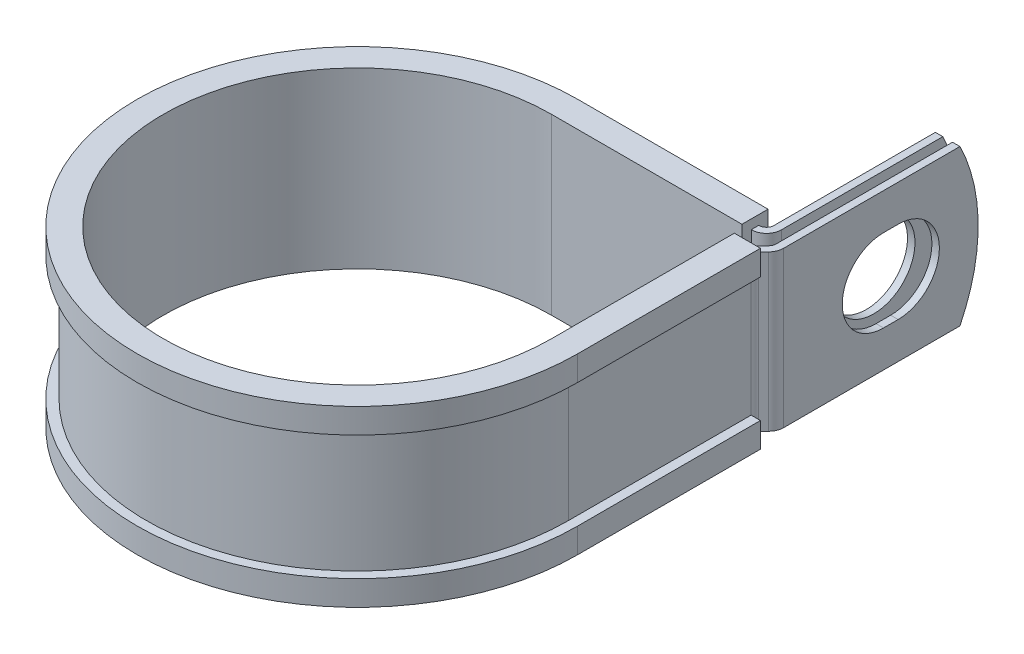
ISO-10303-21;
HEADER;
FILE_DESCRIPTION(('STEP AP214'),'2;1');
FILE_NAME('part.step','',(''),(''),'','','');
FILE_SCHEMA(('AUTOMOTIVE_DESIGN { 1 0 10303 214 1 1 1 1 }'));
ENDSEC;
DATA;
#1=APPLICATION_CONTEXT('core data for automotive mechanical design processes');
#2=APPLICATION_PROTOCOL_DEFINITION('international standard','automotive_design',2000,#1);
#3=PRODUCT_CONTEXT('',#1,'mechanical');
#4=PRODUCT('Part','Part','',(#3));
#5=PRODUCT_RELATED_PRODUCT_CATEGORY('part','',(#4));
#6=PRODUCT_DEFINITION_FORMATION('','',#4);
#7=PRODUCT_DEFINITION_CONTEXT('part definition',#1,'design');
#8=PRODUCT_DEFINITION('design','',#6,#7);
#9=PRODUCT_DEFINITION_SHAPE('','',#8);
#10=(LENGTH_UNIT() NAMED_UNIT(*) SI_UNIT(.MILLI.,.METRE.));
#11=(NAMED_UNIT(*) PLANE_ANGLE_UNIT() SI_UNIT($,.RADIAN.));
#12=(NAMED_UNIT(*) SI_UNIT($,.STERADIAN.) SOLID_ANGLE_UNIT());
#13=UNCERTAINTY_MEASURE_WITH_UNIT(LENGTH_MEASURE(1.E-05),#10,'distance_accuracy_value','');
#14=(GEOMETRIC_REPRESENTATION_CONTEXT(3) GLOBAL_UNCERTAINTY_ASSIGNED_CONTEXT((#13)) GLOBAL_UNIT_ASSIGNED_CONTEXT((#10,
#11,#12)) REPRESENTATION_CONTEXT('',''));
#15=CARTESIAN_POINT('',(0.,0.,0.));
#16=DIRECTION('',(0.,0.,1.));
#17=DIRECTION('',(1.,0.,0.));
#18=AXIS2_PLACEMENT_3D('',#15,#16,#17);
#19=CARTESIAN_POINT('',(33.9522698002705,-12.7,-33.274));
#20=DIRECTION('',(0.,1.,0.));
#21=DIRECTION('',(1.,0.,0.));
#22=AXIS2_PLACEMENT_3D('',#19,#20,#21);
#23=PLANE('',#22);
#24=DIRECTION('',(0.,0.,-1.));
#25=VECTOR('',#24,1.);
#26=CARTESIAN_POINT('',(31.1074698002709,-12.7,-33.274));
#27=LINE('',#26,#25);
#28=CARTESIAN_POINT('',(31.1074698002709,-12.7,-33.274));
#29=VERTEX_POINT('',#28);
#30=CARTESIAN_POINT('',(31.1074698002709,-12.7,-34.4932));
#31=VERTEX_POINT('',#30);
#32=EDGE_CURVE('E506',#29,#31,#27,.T.);
#33=ORIENTED_EDGE('',*,*,#32,.T.);
#34=DIRECTION('',(1.,0.,0.));
#35=VECTOR('',#34,1.);
#36=CARTESIAN_POINT('',(0.,-12.7,-34.4932));
#37=LINE('',#36,#35);
#38=CARTESIAN_POINT('',(31.1582698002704,-12.7,-34.4932));
#39=VERTEX_POINT('',#38);
#40=EDGE_CURVE('E393',#39,#31,#37,.F.);
#41=ORIENTED_EDGE('',*,*,#40,.F.);
#42=CARTESIAN_POINT('',(31.1582698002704,-12.7,-35.7124));
#43=DIRECTION('',(0.,1.,0.));
#44=DIRECTION('',(1.,0.,0.));
#45=AXIS2_PLACEMENT_3D('',#42,#43,#44);
#46=CIRCLE('',#45,1.2192);
#47=CARTESIAN_POINT('',(32.3774698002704,-12.7,-35.7124));
#48=VERTEX_POINT('',#47);
#49=EDGE_CURVE('E391',#48,#39,#46,.F.);
#50=ORIENTED_EDGE('',*,*,#49,.F.);
#51=DIRECTION('',(0.,0.,-1.));
#52=VECTOR('',#51,1.);
#53=CARTESIAN_POINT('',(32.3774698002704,-12.7,-65.0748));
#54=LINE('',#53,#52);
#55=CARTESIAN_POINT('',(32.3774698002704,-12.7,-62.0974683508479));
#56=VERTEX_POINT('',#55);
#57=EDGE_CURVE('E389',#56,#48,#54,.F.);
#58=ORIENTED_EDGE('',*,*,#57,.F.);
#59=DIRECTION('',(-1.,0.,0.));
#60=VECTOR('',#59,1.);
#61=CARTESIAN_POINT('',(36.3906698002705,-12.7,-62.0974683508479));
#62=LINE('',#61,#60);
#63=CARTESIAN_POINT('',(33.5966698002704,-12.7,-62.0974683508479));
#64=VERTEX_POINT('',#63);
#65=EDGE_CURVE('E11',#64,#56,#62,.T.);
#66=ORIENTED_EDGE('',*,*,#65,.F.);
#67=DIRECTION('',(0.,0.,1.));
#68=VECTOR('',#67,1.);
#69=CARTESIAN_POINT('',(33.5966698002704,-12.7,-65.0748));
#70=LINE('',#69,#68);
#71=CARTESIAN_POINT('',(33.5966698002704,-12.7,-35.7124));
#72=VERTEX_POINT('',#71);
#73=EDGE_CURVE('E387',#64,#72,#70,.T.);
#74=ORIENTED_EDGE('',*,*,#73,.T.);
#75=CARTESIAN_POINT('',(31.1582698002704,-12.7,-35.7124));
#76=DIRECTION('',(0.,-1.,0.));
#77=DIRECTION('',(0.,0.,1.));
#78=AXIS2_PLACEMENT_3D('',#75,#76,#77);
#79=CIRCLE('',#78,2.4384);
#80=CARTESIAN_POINT('',(31.1582698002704,-12.7,-33.274));
#81=VERTEX_POINT('',#80);
#82=EDGE_CURVE('E384',#72,#81,#79,.T.);
#83=ORIENTED_EDGE('',*,*,#82,.T.);
#84=DIRECTION('',(-1.,0.,0.));
#85=VECTOR('',#84,1.);
#86=CARTESIAN_POINT('',(0.,-12.7,-33.274));
#87=LINE('',#86,#85);
#88=EDGE_CURVE('E381',#81,#29,#87,.T.);
#89=ORIENTED_EDGE('',*,*,#88,.T.);
#90=EDGE_LOOP('',(#33,#41,#50,#58,#66,#74,#83,#89));
#91=FACE_BOUND('',#90,.T.);
#92=ADVANCED_FACE('F37',(#91),#23,.F.);
#93=CARTESIAN_POINT('',(33.9522698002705,12.7,-33.274));
#94=DIRECTION('',(0.,1.,0.));
#95=DIRECTION('',(1.,0.,0.));
#96=AXIS2_PLACEMENT_3D('',#93,#94,#95);
#97=PLANE('',#96);
#98=DIRECTION('',(1.,0.,0.));
#99=VECTOR('',#98,1.);
#100=CARTESIAN_POINT('',(0.,12.7,-34.4932));
#101=LINE('',#100,#99);
#102=CARTESIAN_POINT('',(31.1582698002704,12.7,-34.4932));
#103=VERTEX_POINT('',#102);
#104=CARTESIAN_POINT('',(31.1074698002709,12.7,-34.4932));
#105=VERTEX_POINT('',#104);
#106=EDGE_CURVE('E351',#103,#105,#101,.F.);
#107=ORIENTED_EDGE('',*,*,#106,.T.);
#108=DIRECTION('',(0.,0.,1.));
#109=VECTOR('',#108,1.);
#110=CARTESIAN_POINT('',(31.1074698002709,12.7,-34.4932));
#111=LINE('',#110,#109);
#112=CARTESIAN_POINT('',(31.1074698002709,12.7,-33.274));
#113=VERTEX_POINT('',#112);
#114=EDGE_CURVE('E500',#105,#113,#111,.T.);
#115=ORIENTED_EDGE('',*,*,#114,.T.);
#116=DIRECTION('',(-1.,0.,0.));
#117=VECTOR('',#116,1.);
#118=CARTESIAN_POINT('',(0.,12.7,-33.274));
#119=LINE('',#118,#117);
#120=CARTESIAN_POINT('',(31.1582698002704,12.7,-33.274));
#121=VERTEX_POINT('',#120);
#122=EDGE_CURVE('E608',#121,#113,#119,.T.);
#123=ORIENTED_EDGE('',*,*,#122,.F.);
#124=CARTESIAN_POINT('',(31.1582698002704,12.7,-35.7124));
#125=DIRECTION('',(0.,-1.,0.));
#126=DIRECTION('',(0.,0.,1.));
#127=AXIS2_PLACEMENT_3D('',#124,#125,#126);
#128=CIRCLE('',#127,2.4384);
#129=CARTESIAN_POINT('',(33.5966698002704,12.7,-35.7124));
#130=VERTEX_POINT('',#129);
#131=EDGE_CURVE('E353',#130,#121,#128,.T.);
#132=ORIENTED_EDGE('',*,*,#131,.F.);
#133=DIRECTION('',(0.,0.,1.));
#134=VECTOR('',#133,1.);
#135=CARTESIAN_POINT('',(33.5966698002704,12.7,-65.0748));
#136=LINE('',#135,#134);
#137=CARTESIAN_POINT('',(33.5966698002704,12.7,-62.0974683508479));
#138=VERTEX_POINT('',#137);
#139=EDGE_CURVE('E344',#138,#130,#136,.T.);
#140=ORIENTED_EDGE('',*,*,#139,.F.);
#141=DIRECTION('',(-1.,0.,0.));
#142=VECTOR('',#141,1.);
#143=CARTESIAN_POINT('',(36.3906698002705,12.7,-62.0974683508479));
#144=LINE('',#143,#142);
#145=CARTESIAN_POINT('',(32.3774698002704,12.7,-62.0974683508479));
#146=VERTEX_POINT('',#145);
#147=EDGE_CURVE('E45',#138,#146,#144,.T.);
#148=ORIENTED_EDGE('',*,*,#147,.T.);
#149=DIRECTION('',(0.,0.,-1.));
#150=VECTOR('',#149,1.);
#151=CARTESIAN_POINT('',(32.3774698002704,12.7,-65.0748));
#152=LINE('',#151,#150);
#153=CARTESIAN_POINT('',(32.3774698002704,12.7,-35.7124));
#154=VERTEX_POINT('',#153);
#155=EDGE_CURVE('E341',#146,#154,#152,.F.);
#156=ORIENTED_EDGE('',*,*,#155,.T.);
#157=CARTESIAN_POINT('',(31.1582698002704,12.7,-35.7124));
#158=DIRECTION('',(0.,1.,0.));
#159=DIRECTION('',(1.,0.,0.));
#160=AXIS2_PLACEMENT_3D('',#157,#158,#159);
#161=CIRCLE('',#160,1.2192);
#162=EDGE_CURVE('E349',#154,#103,#161,.F.);
#163=ORIENTED_EDGE('',*,*,#162,.T.);
#164=EDGE_LOOP('',(#107,#115,#123,#132,#140,#148,#156,#163));
#165=FACE_BOUND('',#164,.T.);
#166=ADVANCED_FACE('F340',(#165),#97,.T.);
#167=CARTESIAN_POINT('',(0.,12.7,-33.274));
#168=DIRECTION('',(0.,0.,1.));
#169=DIRECTION('',(1.,0.,0.));
#170=AXIS2_PLACEMENT_3D('',#167,#168,#169);
#171=PLANE('',#170);
#172=ORIENTED_EDGE('',*,*,#122,.T.);
#173=DIRECTION('',(0.,-1.,0.));
#174=VECTOR('',#173,1.);
#175=CARTESIAN_POINT('',(31.1074698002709,12.7,-33.274));
#176=LINE('',#175,#174);
#177=EDGE_CURVE('E503',#113,#29,#176,.T.);
#178=ORIENTED_EDGE('',*,*,#177,.T.);
#179=ORIENTED_EDGE('',*,*,#88,.F.);
#180=DIRECTION('',(0.,-1.,0.));
#181=VECTOR('',#180,1.);
#182=CARTESIAN_POINT('',(31.1582698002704,12.7,-33.274));
#183=LINE('',#182,#181);
#184=EDGE_CURVE('E327',#121,#81,#183,.T.);
#185=ORIENTED_EDGE('',*,*,#184,.F.);
#186=EDGE_LOOP('',(#172,#178,#179,#185));
#187=FACE_BOUND('',#186,.T.);
#188=ADVANCED_FACE('F618',(#187),#171,.T.);
#189=CARTESIAN_POINT('',(36.3906698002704,12.7,-33.274));
#190=DIRECTION('',(-1.,0.,0.));
#191=DIRECTION('',(0.,0.,1.));
#192=AXIS2_PLACEMENT_3D('',#189,#190,#191);
#193=PLANE('',#192);
#194=CARTESIAN_POINT('',(36.3906698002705,0.,-51.9937999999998));
#195=DIRECTION('',(1.,0.,0.));
#196=DIRECTION('',(0.,0.,-1.));
#197=AXIS2_PLACEMENT_3D('',#194,#195,#196);
#198=CIRCLE('',#197,6.7437);
#199=CARTESIAN_POINT('',(36.3906698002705,-6.7437,-51.9938000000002));
#200=VERTEX_POINT('',#199);
#201=CARTESIAN_POINT('',(36.3906698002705,6.7437,-51.9938000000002));
#202=VERTEX_POINT('',#201);
#203=EDGE_CURVE('E563',#200,#202,#198,.T.);
#204=ORIENTED_EDGE('',*,*,#203,.F.);
#205=DIRECTION('',(0.,0.,-1.));
#206=VECTOR('',#205,1.);
#207=CARTESIAN_POINT('',(36.3906698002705,-6.7437,-49.6061999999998));
#208=LINE('',#207,#206);
#209=CARTESIAN_POINT('',(36.3906698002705,-6.7437,-49.6061999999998));
#210=VERTEX_POINT('',#209);
#211=EDGE_CURVE('E566',#210,#200,#208,.T.);
#212=ORIENTED_EDGE('',*,*,#211,.F.);
#213=CARTESIAN_POINT('',(36.3906698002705,0.,-49.6061999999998));
#214=DIRECTION('',(1.,0.,0.));
#215=DIRECTION('',(0.,0.,-1.));
#216=AXIS2_PLACEMENT_3D('',#213,#214,#215);
#217=CIRCLE('',#216,6.7437);
#218=CARTESIAN_POINT('',(36.3906698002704,6.7437,-49.6061999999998));
#219=VERTEX_POINT('',#218);
#220=EDGE_CURVE('E559',#219,#210,#217,.T.);
#221=ORIENTED_EDGE('',*,*,#220,.F.);
#222=DIRECTION('',(0.,0.,1.));
#223=VECTOR('',#222,1.);
#224=CARTESIAN_POINT('',(36.3906698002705,6.7437,-49.6061999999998));
#225=LINE('',#224,#223);
#226=EDGE_CURVE('E560',#202,#219,#225,.T.);
#227=ORIENTED_EDGE('',*,*,#226,.F.);
#228=EDGE_LOOP('',(#204,#212,#221,#227));
#229=FACE_BOUND('',#228,.T.);
#230=DIRECTION('',(0.,0.,-1.));
#231=VECTOR('',#230,1.);
#232=CARTESIAN_POINT('',(36.3906698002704,-12.7,-33.274));
#233=LINE('',#232,#231);
#234=CARTESIAN_POINT('',(36.3906698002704,-12.7,-33.274));
#235=VERTEX_POINT('',#234);
#236=CARTESIAN_POINT('',(36.3906698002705,-12.7,-62.0974683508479));
#237=VERTEX_POINT('',#236);
#238=EDGE_CURVE('E365',#235,#237,#233,.T.);
#239=ORIENTED_EDGE('',*,*,#238,.T.);
#240=CARTESIAN_POINT('',(36.3906698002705,0.,-36.4998));
#241=DIRECTION('',(-1.,0.,0.));
#242=DIRECTION('',(0.,0.,1.));
#243=AXIS2_PLACEMENT_3D('',#240,#241,#242);
#244=CIRCLE('',#243,28.575);
#245=CARTESIAN_POINT('',(36.3906698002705,12.7,-62.0974683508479));
#246=VERTEX_POINT('',#245);
#247=EDGE_CURVE('E551',#246,#237,#244,.T.);
#248=ORIENTED_EDGE('',*,*,#247,.F.);
#249=DIRECTION('',(0.,0.,-1.));
#250=VECTOR('',#249,1.);
#251=CARTESIAN_POINT('',(36.3906698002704,12.7,-33.274));
#252=LINE('',#251,#250);
#253=CARTESIAN_POINT('',(36.3906698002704,12.7,-33.274));
#254=VERTEX_POINT('',#253);
#255=EDGE_CURVE('E402',#254,#246,#252,.T.);
#256=ORIENTED_EDGE('',*,*,#255,.F.);
#257=DIRECTION('',(0.,-1.,0.));
#258=VECTOR('',#257,1.);
#259=CARTESIAN_POINT('',(36.3906698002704,12.7,-33.274));
#260=LINE('',#259,#258);
#261=EDGE_CURVE('E364',#254,#235,#260,.T.);
#262=ORIENTED_EDGE('',*,*,#261,.T.);
#263=EDGE_LOOP('',(#239,#248,#256,#262));
#264=FACE_BOUND('',#263,.T.);
#265=ADVANCED_FACE('F39',(#229,#264),#193,.F.);
#266=CARTESIAN_POINT('',(35.1714698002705,12.7,-33.274));
#267=DIRECTION('',(-1.,0.,0.));
#268=DIRECTION('',(0.,0.,1.));
#269=AXIS2_PLACEMENT_3D('',#266,#267,#268);
#270=PLANE('',#269);
#271=DIRECTION('',(0.,0.,-1.));
#272=VECTOR('',#271,1.);
#273=CARTESIAN_POINT('',(35.1714698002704,-6.7437,-49.6061999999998));
#274=LINE('',#273,#272);
#275=CARTESIAN_POINT('',(35.1714698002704,-6.7437,-49.6061999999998));
#276=VERTEX_POINT('',#275);
#277=CARTESIAN_POINT('',(35.1714698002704,-6.7437,-51.9938000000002));
#278=VERTEX_POINT('',#277);
#279=EDGE_CURVE('E562',#276,#278,#274,.T.);
#280=ORIENTED_EDGE('',*,*,#279,.T.);
#281=CARTESIAN_POINT('',(35.1714698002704,0.,-51.9937999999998));
#282=DIRECTION('',(-1.,0.,0.));
#283=DIRECTION('',(0.,0.,1.));
#284=AXIS2_PLACEMENT_3D('',#281,#282,#283);
#285=CIRCLE('',#284,6.7437);
#286=CARTESIAN_POINT('',(35.1714698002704,6.7437,-51.9938000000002));
#287=VERTEX_POINT('',#286);
#288=EDGE_CURVE('E583',#278,#287,#285,.F.);
#289=ORIENTED_EDGE('',*,*,#288,.T.);
#290=DIRECTION('',(0.,0.,1.));
#291=VECTOR('',#290,1.);
#292=CARTESIAN_POINT('',(35.1714698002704,6.7437,-49.6061999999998));
#293=LINE('',#292,#291);
#294=CARTESIAN_POINT('',(35.1714698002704,6.7437,-49.6061999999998));
#295=VERTEX_POINT('',#294);
#296=EDGE_CURVE('E579',#287,#295,#293,.T.);
#297=ORIENTED_EDGE('',*,*,#296,.T.);
#298=CARTESIAN_POINT('',(35.1714698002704,0.,-49.6061999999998));
#299=DIRECTION('',(-1.,0.,0.));
#300=DIRECTION('',(0.,0.,1.));
#301=AXIS2_PLACEMENT_3D('',#298,#299,#300);
#302=CIRCLE('',#301,6.7437);
#303=EDGE_CURVE('E574',#295,#276,#302,.F.);
#304=ORIENTED_EDGE('',*,*,#303,.T.);
#305=EDGE_LOOP('',(#280,#289,#297,#304));
#306=FACE_BOUND('',#305,.T.);
#307=CARTESIAN_POINT('',(35.1714698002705,0.,-36.4998));
#308=DIRECTION('',(-1.,0.,0.));
#309=DIRECTION('',(0.,0.,1.));
#310=AXIS2_PLACEMENT_3D('',#307,#308,#309);
#311=CIRCLE('',#310,28.575);
#312=CARTESIAN_POINT('',(35.1714698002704,12.7,-62.0974683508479));
#313=VERTEX_POINT('',#312);
#314=CARTESIAN_POINT('',(35.1714698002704,-12.7,-62.0974683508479));
#315=VERTEX_POINT('',#314);
#316=EDGE_CURVE('E59',#313,#315,#311,.T.);
#317=ORIENTED_EDGE('',*,*,#316,.T.);
#318=DIRECTION('',(0.,0.,-1.));
#319=VECTOR('',#318,1.);
#320=CARTESIAN_POINT('',(35.1714698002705,-12.7,-33.274));
#321=LINE('',#320,#319);
#322=CARTESIAN_POINT('',(35.1714698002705,-12.7,-33.274));
#323=VERTEX_POINT('',#322);
#324=EDGE_CURVE('E368',#323,#315,#321,.T.);
#325=ORIENTED_EDGE('',*,*,#324,.F.);
#326=DIRECTION('',(0.,-1.,0.));
#327=VECTOR('',#326,1.);
#328=CARTESIAN_POINT('',(35.1714698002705,12.7,-33.274));
#329=LINE('',#328,#327);
#330=CARTESIAN_POINT('',(35.1714698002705,12.7,-33.274));
#331=VERTEX_POINT('',#330);
#332=EDGE_CURVE('E335',#331,#323,#329,.T.);
#333=ORIENTED_EDGE('',*,*,#332,.F.);
#334=DIRECTION('',(0.,0.,-1.));
#335=VECTOR('',#334,1.);
#336=CARTESIAN_POINT('',(35.1714698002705,12.7,-33.274));
#337=LINE('',#336,#335);
#338=EDGE_CURVE('E598',#331,#313,#337,.T.);
#339=ORIENTED_EDGE('',*,*,#338,.T.);
#340=EDGE_LOOP('',(#317,#325,#333,#339));
#341=FACE_BOUND('',#340,.T.);
#342=ADVANCED_FACE('F672',(#306,#341),#270,.T.);
#343=CARTESIAN_POINT('',(33.5966698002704,12.7,-65.0748));
#344=DIRECTION('',(1.,0.,0.));
#345=DIRECTION('',(0.,0.,-1.));
#346=AXIS2_PLACEMENT_3D('',#343,#344,#345);
#347=PLANE('',#346);
#348=CARTESIAN_POINT('',(33.5966698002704,0.,-50.8));
#349=DIRECTION('',(1.,0.,0.));
#350=DIRECTION('',(0.,0.,-1.));
#351=AXIS2_PLACEMENT_3D('',#348,#349,#350);
#352=CIRCLE('',#351,6.7437);
#353=CARTESIAN_POINT('',(33.5966698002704,0.,-57.5437));
#354=VERTEX_POINT('',#353);
#355=EDGE_CURVE('E369',#354,#354,#352,.F.);
#356=ORIENTED_EDGE('',*,*,#355,.T.);
#357=EDGE_LOOP('',(#356));
#358=FACE_BOUND('',#357,.T.);
#359=ORIENTED_EDGE('',*,*,#73,.F.);
#360=CARTESIAN_POINT('',(33.5966698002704,0.,-36.4998));
#361=DIRECTION('',(1.,0.,0.));
#362=DIRECTION('',(0.,0.,-1.));
#363=AXIS2_PLACEMENT_3D('',#360,#361,#362);
#364=CIRCLE('',#363,28.575);
#365=EDGE_CURVE('E556',#64,#138,#364,.T.);
#366=ORIENTED_EDGE('',*,*,#365,.T.);
#367=ORIENTED_EDGE('',*,*,#139,.T.);
#368=DIRECTION('',(0.,-1.,0.));
#369=VECTOR('',#368,1.);
#370=CARTESIAN_POINT('',(33.5966698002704,12.7,-35.7124));
#371=LINE('',#370,#369);
#372=EDGE_CURVE('E324',#130,#72,#371,.T.);
#373=ORIENTED_EDGE('',*,*,#372,.T.);
#374=EDGE_LOOP('',(#359,#366,#367,#373));
#375=FACE_BOUND('',#374,.T.);
#376=ADVANCED_FACE('F624',(#358,#375),#347,.T.);
#377=CARTESIAN_POINT('',(32.3774698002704,12.7,-65.0748));
#378=DIRECTION('',(1.,0.,0.));
#379=DIRECTION('',(0.,0.,-1.));
#380=AXIS2_PLACEMENT_3D('',#377,#378,#379);
#381=PLANE('',#380);
#382=CARTESIAN_POINT('',(32.3774698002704,0.,-50.8));
#383=DIRECTION('',(-1.,0.,0.));
#384=DIRECTION('',(0.,0.,1.));
#385=AXIS2_PLACEMENT_3D('',#382,#383,#384);
#386=CIRCLE('',#385,6.7437);
#387=CARTESIAN_POINT('',(32.3774698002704,0.,-44.0563));
#388=VERTEX_POINT('',#387);
#389=EDGE_CURVE('E591',#388,#388,#386,.T.);
#390=ORIENTED_EDGE('',*,*,#389,.F.);
#391=EDGE_LOOP('',(#390));
#392=FACE_BOUND('',#391,.T.);
#393=CARTESIAN_POINT('',(32.3774698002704,0.,-36.4998));
#394=DIRECTION('',(-1.,0.,0.));
#395=DIRECTION('',(0.,0.,1.));
#396=AXIS2_PLACEMENT_3D('',#393,#394,#395);
#397=CIRCLE('',#396,28.575);
#398=EDGE_CURVE('E51',#146,#56,#397,.T.);
#399=ORIENTED_EDGE('',*,*,#398,.T.);
#400=ORIENTED_EDGE('',*,*,#57,.T.);
#401=DIRECTION('',(0.,-1.,0.));
#402=VECTOR('',#401,1.);
#403=CARTESIAN_POINT('',(32.3774698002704,12.7,-35.7124));
#404=LINE('',#403,#402);
#405=EDGE_CURVE('E321',#154,#48,#404,.T.);
#406=ORIENTED_EDGE('',*,*,#405,.F.);
#407=ORIENTED_EDGE('',*,*,#155,.F.);
#408=EDGE_LOOP('',(#399,#400,#406,#407));
#409=FACE_BOUND('',#408,.T.);
#410=ADVANCED_FACE('F347',(#392,#409),#381,.F.);
#411=CARTESIAN_POINT('',(35.7124,-12.7,-29.8615026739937));
#412=DIRECTION('',(0.,1.,0.));
#413=DIRECTION('',(1.,0.,0.));
#414=AXIS2_PLACEMENT_3D('',#411,#412,#413);
#415=CIRCLE('',#414,1.21919999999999);
#416=CARTESIAN_POINT('',(34.4932,-12.7,-29.8615026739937));
#417=VERTEX_POINT('',#416);
#418=CARTESIAN_POINT('',(34.8502954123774,-12.7,-30.7236072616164));
#419=VERTEX_POINT('',#418);
#420=EDGE_CURVE('E396',#417,#419,#415,.F.);
#421=ORIENTED_EDGE('',*,*,#420,.F.);
#422=DIRECTION('',(1.,0.,0.));
#423=VECTOR('',#422,1.);
#424=CARTESIAN_POINT('',(33.274,-12.7,-29.8615026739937));
#425=LINE('',#424,#423);
#426=CARTESIAN_POINT('',(33.274,-12.7,-29.8615026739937));
#427=VERTEX_POINT('',#426);
#428=EDGE_CURVE('E434',#427,#417,#425,.T.);
#429=ORIENTED_EDGE('',*,*,#428,.F.);
#430=CARTESIAN_POINT('',(35.7124,-12.7,-29.8615026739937));
#431=DIRECTION('',(0.,-1.,0.));
#432=DIRECTION('',(0.,0.,1.));
#433=AXIS2_PLACEMENT_3D('',#430,#431,#432);
#434=CIRCLE('',#433,2.43839999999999);
#435=CARTESIAN_POINT('',(33.9881908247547,-12.7,-31.585711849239));
#436=VERTEX_POINT('',#435);
#437=EDGE_CURVE('E378',#427,#436,#434,.T.);
#438=ORIENTED_EDGE('',*,*,#437,.T.);
#439=DIRECTION('',(0.707106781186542,0.,-0.707106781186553));
#440=VECTOR('',#439,1.);
#441=CARTESIAN_POINT('',(33.9881908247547,-12.7,-31.585711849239));
#442=LINE('',#441,#440);
#443=CARTESIAN_POINT('',(34.8143743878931,-12.7,-32.4118954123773));
#444=VERTEX_POINT('',#443);
#445=EDGE_CURVE('E375',#436,#444,#442,.T.);
#446=ORIENTED_EDGE('',*,*,#445,.T.);
#447=CARTESIAN_POINT('',(33.9522698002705,-12.7,-33.274));
#448=DIRECTION('',(0.,1.,0.));
#449=DIRECTION('',(0.,0.,1.));
#450=AXIS2_PLACEMENT_3D('',#447,#448,#449);
#451=CIRCLE('',#450,1.2192);
#452=EDGE_CURVE('E372',#444,#323,#451,.T.);
#453=ORIENTED_EDGE('',*,*,#452,.T.);
#454=ORIENTED_EDGE('',*,*,#324,.T.);
#455=DIRECTION('',(-1.,0.,0.));
#456=VECTOR('',#455,1.);
#457=CARTESIAN_POINT('',(36.3906698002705,-12.7,-62.0974683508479));
#458=LINE('',#457,#456);
#459=EDGE_CURVE('E549',#237,#315,#458,.T.);
#460=ORIENTED_EDGE('',*,*,#459,.F.);
#461=ORIENTED_EDGE('',*,*,#238,.F.);
#462=CARTESIAN_POINT('',(33.9522698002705,-12.7,-33.274));
#463=DIRECTION('',(0.,1.,0.));
#464=DIRECTION('',(1.,0.,0.));
#465=AXIS2_PLACEMENT_3D('',#462,#463,#464);
#466=CIRCLE('',#465,2.4384);
#467=CARTESIAN_POINT('',(35.6764789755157,-12.7,-31.5497908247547));
#468=VERTEX_POINT('',#467);
#469=EDGE_CURVE('E400',#468,#235,#466,.T.);
#470=ORIENTED_EDGE('',*,*,#469,.F.);
#471=DIRECTION('',(0.707106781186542,0.,-0.707106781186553));
#472=VECTOR('',#471,1.);
#473=CARTESIAN_POINT('',(34.8502954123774,-12.7,-30.7236072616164));
#474=LINE('',#473,#472);
#475=EDGE_CURVE('E398',#419,#468,#474,.T.);
#476=ORIENTED_EDGE('',*,*,#475,.F.);
#477=EDGE_LOOP('',(#421,#429,#438,#446,#453,#454,#460,#461,#470,#476));
#478=FACE_BOUND('',#477,.T.);
#479=ADVANCED_FACE('F658',(#478),#23,.F.);
#480=DIRECTION('',(-1.,0.,0.));
#481=VECTOR('',#480,1.);
#482=CARTESIAN_POINT('',(34.4932,12.7,-29.8615026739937));
#483=LINE('',#482,#481);
#484=CARTESIAN_POINT('',(34.4932,12.7,-29.8615026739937));
#485=VERTEX_POINT('',#484);
#486=CARTESIAN_POINT('',(33.274,12.7,-29.8615026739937));
#487=VERTEX_POINT('',#486);
#488=EDGE_CURVE('E423',#485,#487,#483,.T.);
#489=ORIENTED_EDGE('',*,*,#488,.F.);
#490=CARTESIAN_POINT('',(35.7124,12.7,-29.8615026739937));
#491=DIRECTION('',(0.,1.,0.));
#492=DIRECTION('',(1.,0.,0.));
#493=AXIS2_PLACEMENT_3D('',#490,#491,#492);
#494=CIRCLE('',#493,1.21919999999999);
#495=CARTESIAN_POINT('',(34.8502954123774,12.7,-30.7236072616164));
#496=VERTEX_POINT('',#495);
#497=EDGE_CURVE('E358',#485,#496,#494,.F.);
#498=ORIENTED_EDGE('',*,*,#497,.T.);
#499=DIRECTION('',(0.707106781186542,0.,-0.707106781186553));
#500=VECTOR('',#499,1.);
#501=CARTESIAN_POINT('',(34.8502954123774,12.7,-30.7236072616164));
#502=LINE('',#501,#500);
#503=CARTESIAN_POINT('',(35.6764789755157,12.7,-31.5497908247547));
#504=VERTEX_POINT('',#503);
#505=EDGE_CURVE('E360',#496,#504,#502,.T.);
#506=ORIENTED_EDGE('',*,*,#505,.T.);
#507=CARTESIAN_POINT('',(33.9522698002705,12.7,-33.274));
#508=DIRECTION('',(0.,1.,0.));
#509=DIRECTION('',(1.,0.,0.));
#510=AXIS2_PLACEMENT_3D('',#507,#508,#509);
#511=CIRCLE('',#510,2.4384);
#512=EDGE_CURVE('E362',#504,#254,#511,.T.);
#513=ORIENTED_EDGE('',*,*,#512,.T.);
#514=ORIENTED_EDGE('',*,*,#255,.T.);
#515=DIRECTION('',(-1.,0.,0.));
#516=VECTOR('',#515,1.);
#517=CARTESIAN_POINT('',(36.3906698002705,12.7,-62.0974683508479));
#518=LINE('',#517,#516);
#519=EDGE_CURVE('E553',#246,#313,#518,.T.);
#520=ORIENTED_EDGE('',*,*,#519,.T.);
#521=ORIENTED_EDGE('',*,*,#338,.F.);
#522=CARTESIAN_POINT('',(33.9522698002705,12.7,-33.274));
#523=DIRECTION('',(0.,1.,0.));
#524=DIRECTION('',(0.,0.,1.));
#525=AXIS2_PLACEMENT_3D('',#522,#523,#524);
#526=CIRCLE('',#525,1.2192);
#527=CARTESIAN_POINT('',(34.8143743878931,12.7,-32.4118954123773));
#528=VERTEX_POINT('',#527);
#529=EDGE_CURVE('E601',#528,#331,#526,.T.);
#530=ORIENTED_EDGE('',*,*,#529,.F.);
#531=DIRECTION('',(0.707106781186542,0.,-0.707106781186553));
#532=VECTOR('',#531,1.);
#533=CARTESIAN_POINT('',(33.9881908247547,12.7,-31.585711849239));
#534=LINE('',#533,#532);
#535=CARTESIAN_POINT('',(33.9881908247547,12.7,-31.585711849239));
#536=VERTEX_POINT('',#535);
#537=EDGE_CURVE('E604',#536,#528,#534,.T.);
#538=ORIENTED_EDGE('',*,*,#537,.F.);
#539=CARTESIAN_POINT('',(35.7124,12.7,-29.8615026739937));
#540=DIRECTION('',(0.,-1.,0.));
#541=DIRECTION('',(0.,0.,1.));
#542=AXIS2_PLACEMENT_3D('',#539,#540,#541);
#543=CIRCLE('',#542,2.43839999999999);
#544=EDGE_CURVE('E433',#487,#536,#543,.T.);
#545=ORIENTED_EDGE('',*,*,#544,.F.);
#546=EDGE_LOOP('',(#489,#498,#506,#513,#514,#520,#521,#530,#538,#545));
#547=FACE_BOUND('',#546,.T.);
#548=ADVANCED_FACE('F430',(#547),#97,.T.);
#549=CARTESIAN_POINT('',(33.9522698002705,12.7,-33.274));
#550=DIRECTION('',(0.,-1.,0.));
#551=DIRECTION('',(0.,0.,-1.));
#552=AXIS2_PLACEMENT_3D('',#549,#550,#551);
#553=CYLINDRICAL_SURFACE('',#552,1.2192);
#554=ORIENTED_EDGE('',*,*,#452,.F.);
#555=DIRECTION('',(0.,-1.,0.));
#556=VECTOR('',#555,1.);
#557=CARTESIAN_POINT('',(34.8143743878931,12.7,-32.4118954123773));
#558=LINE('',#557,#556);
#559=EDGE_CURVE('E333',#528,#444,#558,.T.);
#560=ORIENTED_EDGE('',*,*,#559,.F.);
#561=ORIENTED_EDGE('',*,*,#529,.T.);
#562=ORIENTED_EDGE('',*,*,#332,.T.);
#563=EDGE_LOOP('',(#554,#560,#561,#562));
#564=FACE_BOUND('',#563,.T.);
#565=ADVANCED_FACE('F668',(#564),#553,.F.);
#566=CARTESIAN_POINT('',(33.9881908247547,12.7,-31.585711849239));
#567=DIRECTION('',(-0.707106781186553,0.,-0.707106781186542));
#568=DIRECTION('',(-0.707106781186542,0.,0.707106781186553));
#569=AXIS2_PLACEMENT_3D('',#566,#567,#568);
#570=PLANE('',#569);
#571=ORIENTED_EDGE('',*,*,#445,.F.);
#572=DIRECTION('',(0.,-1.,0.));
#573=VECTOR('',#572,1.);
#574=CARTESIAN_POINT('',(33.9881908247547,12.7,-31.585711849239));
#575=LINE('',#574,#573);
#576=EDGE_CURVE('E331',#536,#436,#575,.T.);
#577=ORIENTED_EDGE('',*,*,#576,.F.);
#578=ORIENTED_EDGE('',*,*,#537,.T.);
#579=ORIENTED_EDGE('',*,*,#559,.T.);
#580=EDGE_LOOP('',(#571,#577,#578,#579));
#581=FACE_BOUND('',#580,.T.);
#582=ADVANCED_FACE('F663',(#581),#570,.T.);
#583=CARTESIAN_POINT('',(35.7124,12.7,-29.8615026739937));
#584=DIRECTION('',(0.,-1.,0.));
#585=DIRECTION('',(0.,0.,-1.));
#586=AXIS2_PLACEMENT_3D('',#583,#584,#585);
#587=CYLINDRICAL_SURFACE('',#586,2.43839999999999);
#588=ORIENTED_EDGE('',*,*,#437,.F.);
#589=DIRECTION('',(0.,-1.,0.));
#590=VECTOR('',#589,1.);
#591=CARTESIAN_POINT('',(33.274,12.7,-29.8615026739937));
#592=LINE('',#591,#590);
#593=EDGE_CURVE('E329',#487,#427,#592,.T.);
#594=ORIENTED_EDGE('',*,*,#593,.F.);
#595=ORIENTED_EDGE('',*,*,#544,.T.);
#596=ORIENTED_EDGE('',*,*,#576,.T.);
#597=EDGE_LOOP('',(#588,#594,#595,#596));
#598=FACE_BOUND('',#597,.T.);
#599=ADVANCED_FACE('F660',(#598),#587,.T.);
#600=CARTESIAN_POINT('',(31.1582698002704,12.7,-35.7124));
#601=DIRECTION('',(0.,-1.,0.));
#602=DIRECTION('',(0.,0.,-1.));
#603=AXIS2_PLACEMENT_3D('',#600,#601,#602);
#604=CYLINDRICAL_SURFACE('',#603,2.4384);
#605=ORIENTED_EDGE('',*,*,#82,.F.);
#606=ORIENTED_EDGE('',*,*,#372,.F.);
#607=ORIENTED_EDGE('',*,*,#131,.T.);
#608=ORIENTED_EDGE('',*,*,#184,.T.);
#609=EDGE_LOOP('',(#605,#606,#607,#608));
#610=FACE_BOUND('',#609,.T.);
#611=ADVANCED_FACE('F614',(#610),#604,.T.);
#612=CARTESIAN_POINT('',(31.1582698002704,12.7,-35.7124));
#613=DIRECTION('',(0.,-1.,0.));
#614=DIRECTION('',(0.,0.,-1.));
#615=AXIS2_PLACEMENT_3D('',#612,#613,#614);
#616=CYLINDRICAL_SURFACE('',#615,1.2192);
#617=ORIENTED_EDGE('',*,*,#49,.T.);
#618=DIRECTION('',(0.,-1.,0.));
#619=VECTOR('',#618,1.);
#620=CARTESIAN_POINT('',(31.1582698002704,12.7,-34.4932));
#621=LINE('',#620,#619);
#622=EDGE_CURVE('E312',#103,#39,#621,.T.);
#623=ORIENTED_EDGE('',*,*,#622,.F.);
#624=ORIENTED_EDGE('',*,*,#162,.F.);
#625=ORIENTED_EDGE('',*,*,#405,.T.);
#626=EDGE_LOOP('',(#617,#623,#624,#625));
#627=FACE_BOUND('',#626,.T.);
#628=ADVANCED_FACE('F629',(#627),#616,.F.);
#629=CARTESIAN_POINT('',(0.,12.7,-34.4932));
#630=DIRECTION('',(0.,0.,1.));
#631=DIRECTION('',(1.,0.,0.));
#632=AXIS2_PLACEMENT_3D('',#629,#630,#631);
#633=PLANE('',#632);
#634=DIRECTION('',(0.,-1.,0.));
#635=VECTOR('',#634,1.);
#636=CARTESIAN_POINT('',(0.,12.7,-34.4932));
#637=LINE('',#636,#635);
#638=CARTESIAN_POINT('',(4.83841555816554E-13,10.16,-34.4932));
#639=VERTEX_POINT('',#638);
#640=CARTESIAN_POINT('',(4.83841555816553E-13,-10.16,-34.4932));
#641=VERTEX_POINT('',#640);
#642=EDGE_CURVE('E303',#639,#641,#637,.T.);
#643=ORIENTED_EDGE('',*,*,#642,.F.);
#644=DIRECTION('',(1.,0.,0.));
#645=VECTOR('',#644,1.);
#646=CARTESIAN_POINT('',(4.83841555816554E-13,10.16,-34.4932));
#647=LINE('',#646,#645);
#648=CARTESIAN_POINT('',(31.1074698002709,10.16,-34.4932));
#649=VERTEX_POINT('',#648);
#650=EDGE_CURVE('E546',#639,#649,#647,.T.);
#651=ORIENTED_EDGE('',*,*,#650,.T.);
#652=DIRECTION('',(0.,1.,0.));
#653=VECTOR('',#652,1.);
#654=CARTESIAN_POINT('',(31.1074698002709,12.7,-34.4932));
#655=LINE('',#654,#653);
#656=EDGE_CURVE('E497',#649,#105,#655,.T.);
#657=ORIENTED_EDGE('',*,*,#656,.T.);
#658=ORIENTED_EDGE('',*,*,#106,.F.);
#659=ORIENTED_EDGE('',*,*,#622,.T.);
#660=ORIENTED_EDGE('',*,*,#40,.T.);
#661=DIRECTION('',(0.,1.,0.));
#662=VECTOR('',#661,1.);
#663=CARTESIAN_POINT('',(31.1074698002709,-12.7,-34.4932));
#664=LINE('',#663,#662);
#665=CARTESIAN_POINT('',(31.1074698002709,-10.16,-34.4932));
#666=VERTEX_POINT('',#665);
#667=EDGE_CURVE('E509',#31,#666,#664,.T.);
#668=ORIENTED_EDGE('',*,*,#667,.T.);
#669=DIRECTION('',(1.,0.,0.));
#670=VECTOR('',#669,1.);
#671=CARTESIAN_POINT('',(4.83841555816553E-13,-10.16,-34.4932));
#672=LINE('',#671,#670);
#673=EDGE_CURVE('E526',#641,#666,#672,.T.);
#674=ORIENTED_EDGE('',*,*,#673,.F.);
#675=EDGE_LOOP('',(#643,#651,#657,#658,#659,#660,#668,#674));
#676=FACE_BOUND('',#675,.T.);
#677=ADVANCED_FACE('F633',(#676),#633,.F.);
#678=CARTESIAN_POINT('',(0.,12.7,0.));
#679=DIRECTION('',(0.,-1.,0.));
#680=DIRECTION('',(0.,0.,-1.));
#681=AXIS2_PLACEMENT_3D('',#678,#679,#680);
#682=CYLINDRICAL_SURFACE('',#681,34.4932);
#683=DIRECTION('',(0.,-1.,0.));
#684=VECTOR('',#683,1.);
#685=CARTESIAN_POINT('',(34.4932,12.7,0.));
#686=LINE('',#685,#684);
#687=CARTESIAN_POINT('',(34.4932,10.16,0.));
#688=VERTEX_POINT('',#687);
#689=CARTESIAN_POINT('',(34.4932,-10.16,0.));
#690=VERTEX_POINT('',#689);
#691=EDGE_CURVE('E301',#688,#690,#686,.T.);
#692=ORIENTED_EDGE('',*,*,#691,.F.);
#693=CARTESIAN_POINT('',(0.,10.16,0.));
#694=DIRECTION('',(0.,-1.,0.));
#695=DIRECTION('',(0.,0.,-1.));
#696=AXIS2_PLACEMENT_3D('',#693,#694,#695);
#697=CIRCLE('',#696,34.4932);
#698=EDGE_CURVE('E495',#688,#639,#697,.T.);
#699=ORIENTED_EDGE('',*,*,#698,.T.);
#700=ORIENTED_EDGE('',*,*,#642,.T.);
#701=CARTESIAN_POINT('',(0.,-10.16,0.));
#702=DIRECTION('',(0.,-1.,0.));
#703=DIRECTION('',(0.,0.,-1.));
#704=AXIS2_PLACEMENT_3D('',#701,#702,#703);
#705=CIRCLE('',#704,34.4932);
#706=EDGE_CURVE('E284',#690,#641,#705,.T.);
#707=ORIENTED_EDGE('',*,*,#706,.F.);
#708=EDGE_LOOP('',(#692,#699,#700,#707));
#709=FACE_BOUND('',#708,.T.);
#710=ADVANCED_FACE('F299',(#709),#682,.T.);
#711=CARTESIAN_POINT('',(34.4932,12.7,0.));
#712=DIRECTION('',(-1.,0.,0.));
#713=DIRECTION('',(0.,0.,1.));
#714=AXIS2_PLACEMENT_3D('',#711,#712,#713);
#715=PLANE('',#714);
#716=DIRECTION('',(0.,-1.,0.));
#717=VECTOR('',#716,1.);
#718=CARTESIAN_POINT('',(34.4932,12.7,-29.8615026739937));
#719=LINE('',#718,#717);
#720=CARTESIAN_POINT('',(34.4932,10.16,-29.8615026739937));
#721=VERTEX_POINT('',#720);
#722=CARTESIAN_POINT('',(34.4932,-10.16,-29.8615026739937));
#723=VERTEX_POINT('',#722);
#724=EDGE_CURVE('E315',#721,#723,#719,.T.);
#725=ORIENTED_EDGE('',*,*,#724,.F.);
#726=DIRECTION('',(0.,0.,-1.));
#727=VECTOR('',#726,1.);
#728=CARTESIAN_POINT('',(34.4932,10.16,0.));
#729=LINE('',#728,#727);
#730=EDGE_CURVE('E309',#688,#721,#729,.T.);
#731=ORIENTED_EDGE('',*,*,#730,.F.);
#732=ORIENTED_EDGE('',*,*,#691,.T.);
#733=DIRECTION('',(0.,0.,-1.));
#734=VECTOR('',#733,1.);
#735=CARTESIAN_POINT('',(34.4932,-10.16,0.));
#736=LINE('',#735,#734);
#737=EDGE_CURVE('E280',#690,#723,#736,.T.);
#738=ORIENTED_EDGE('',*,*,#737,.T.);
#739=EDGE_LOOP('',(#725,#731,#732,#738));
#740=FACE_BOUND('',#739,.T.);
#741=ADVANCED_FACE('F308',(#740),#715,.F.);
#742=CARTESIAN_POINT('',(35.7124,12.7,-29.8615026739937));
#743=DIRECTION('',(0.,-1.,0.));
#744=DIRECTION('',(0.,0.,-1.));
#745=AXIS2_PLACEMENT_3D('',#742,#743,#744);
#746=CYLINDRICAL_SURFACE('',#745,1.21919999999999);
#747=ORIENTED_EDGE('',*,*,#420,.T.);
#748=DIRECTION('',(0.,-1.,0.));
#749=VECTOR('',#748,1.);
#750=CARTESIAN_POINT('',(34.8502954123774,12.7,-30.7236072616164));
#751=LINE('',#750,#749);
#752=EDGE_CURVE('E407',#496,#419,#751,.T.);
#753=ORIENTED_EDGE('',*,*,#752,.F.);
#754=ORIENTED_EDGE('',*,*,#497,.F.);
#755=EDGE_CURVE('E310',#485,#721,#719,.T.);
#756=ORIENTED_EDGE('',*,*,#755,.T.);
#757=ORIENTED_EDGE('',*,*,#724,.T.);
#758=DIRECTION('',(0.,1.,0.));
#759=VECTOR('',#758,1.);
#760=CARTESIAN_POINT('',(34.4932,-12.7,-29.8615026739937));
#761=LINE('',#760,#759);
#762=EDGE_CURVE('E416',#417,#723,#761,.T.);
#763=ORIENTED_EDGE('',*,*,#762,.F.);
#764=EDGE_LOOP('',(#747,#753,#754,#756,#757,#763));
#765=FACE_BOUND('',#764,.T.);
#766=ADVANCED_FACE('F415',(#765),#746,.F.);
#767=CARTESIAN_POINT('',(34.8502954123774,12.7,-30.7236072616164));
#768=DIRECTION('',(-0.707106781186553,0.,-0.707106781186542));
#769=DIRECTION('',(-0.707106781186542,0.,0.707106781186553));
#770=AXIS2_PLACEMENT_3D('',#767,#768,#769);
#771=PLANE('',#770);
#772=ORIENTED_EDGE('',*,*,#475,.T.);
#773=DIRECTION('',(0.,-1.,0.));
#774=VECTOR('',#773,1.);
#775=CARTESIAN_POINT('',(35.6764789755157,12.7,-31.5497908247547));
#776=LINE('',#775,#774);
#777=EDGE_CURVE('E405',#504,#468,#776,.T.);
#778=ORIENTED_EDGE('',*,*,#777,.F.);
#779=ORIENTED_EDGE('',*,*,#505,.F.);
#780=ORIENTED_EDGE('',*,*,#752,.T.);
#781=EDGE_LOOP('',(#772,#778,#779,#780));
#782=FACE_BOUND('',#781,.T.);
#783=ADVANCED_FACE('F684',(#782),#771,.F.);
#784=CARTESIAN_POINT('',(33.9522698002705,12.7,-33.274));
#785=DIRECTION('',(0.,-1.,0.));
#786=DIRECTION('',(0.,0.,-1.));
#787=AXIS2_PLACEMENT_3D('',#784,#785,#786);
#788=CYLINDRICAL_SURFACE('',#787,2.4384);
#789=ORIENTED_EDGE('',*,*,#469,.T.);
#790=ORIENTED_EDGE('',*,*,#261,.F.);
#791=ORIENTED_EDGE('',*,*,#512,.F.);
#792=ORIENTED_EDGE('',*,*,#777,.T.);
#793=EDGE_LOOP('',(#789,#790,#791,#792));
#794=FACE_BOUND('',#793,.T.);
#795=ADVANCED_FACE('F682',(#794),#788,.T.);
#796=CARTESIAN_POINT('',(52.6707338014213,0.,-50.8));
#797=DIRECTION('',(-1.,0.,0.));
#798=DIRECTION('',(0.,0.,1.));
#799=AXIS2_PLACEMENT_3D('',#796,#797,#798);
#800=CYLINDRICAL_SURFACE('',#799,6.7437);
#801=ORIENTED_EDGE('',*,*,#389,.T.);
#802=EDGE_LOOP('',(#801));
#803=FACE_BOUND('',#802,.T.);
#804=ORIENTED_EDGE('',*,*,#355,.F.);
#805=EDGE_LOOP('',(#804));
#806=FACE_BOUND('',#805,.T.);
#807=ADVANCED_FACE('F691',(#803,#806),#800,.F.);
#808=CARTESIAN_POINT('',(14.3405892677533,-6.7437,-49.6061999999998));
#809=DIRECTION('',(0.,-1.,0.));
#810=DIRECTION('',(0.,0.,-1.));
#811=AXIS2_PLACEMENT_3D('',#808,#809,#810);
#812=PLANE('',#811);
#813=DIRECTION('',(1.,0.,0.));
#814=VECTOR('',#813,1.);
#815=CARTESIAN_POINT('',(14.3405892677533,-6.7437,-49.6061999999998));
#816=LINE('',#815,#814);
#817=EDGE_CURVE('E577',#276,#210,#816,.T.);
#818=ORIENTED_EDGE('',*,*,#817,.T.);
#819=ORIENTED_EDGE('',*,*,#211,.T.);
#820=DIRECTION('',(1.,0.,0.));
#821=VECTOR('',#820,1.);
#822=CARTESIAN_POINT('',(14.3405892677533,-6.7437,-51.9938000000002));
#823=LINE('',#822,#821);
#824=EDGE_CURVE('E573',#278,#200,#823,.T.);
#825=ORIENTED_EDGE('',*,*,#824,.F.);
#826=ORIENTED_EDGE('',*,*,#279,.F.);
#827=EDGE_LOOP('',(#818,#819,#825,#826));
#828=FACE_BOUND('',#827,.T.);
#829=ADVANCED_FACE('F734',(#828),#812,.F.);
#830=CARTESIAN_POINT('',(14.3405892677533,0.,-51.9937999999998));
#831=DIRECTION('',(1.,0.,0.));
#832=DIRECTION('',(0.,0.,-1.));
#833=AXIS2_PLACEMENT_3D('',#830,#831,#832);
#834=CYLINDRICAL_SURFACE('',#833,6.7437);
#835=ORIENTED_EDGE('',*,*,#824,.T.);
#836=ORIENTED_EDGE('',*,*,#203,.T.);
#837=DIRECTION('',(1.,0.,0.));
#838=VECTOR('',#837,1.);
#839=CARTESIAN_POINT('',(14.3405892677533,6.7437,-51.9938000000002));
#840=LINE('',#839,#838);
#841=EDGE_CURVE('E582',#287,#202,#840,.T.);
#842=ORIENTED_EDGE('',*,*,#841,.F.);
#843=ORIENTED_EDGE('',*,*,#288,.F.);
#844=EDGE_LOOP('',(#835,#836,#842,#843));
#845=FACE_BOUND('',#844,.T.);
#846=ADVANCED_FACE('F738',(#845),#834,.F.);
#847=CARTESIAN_POINT('',(14.3405892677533,6.7437,-49.6061999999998));
#848=DIRECTION('',(0.,1.,0.));
#849=DIRECTION('',(0.,0.,1.));
#850=AXIS2_PLACEMENT_3D('',#847,#848,#849);
#851=PLANE('',#850);
#852=ORIENTED_EDGE('',*,*,#841,.T.);
#853=ORIENTED_EDGE('',*,*,#226,.T.);
#854=DIRECTION('',(1.,0.,0.));
#855=VECTOR('',#854,1.);
#856=CARTESIAN_POINT('',(14.3405892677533,6.7437,-49.6061999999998));
#857=LINE('',#856,#855);
#858=EDGE_CURVE('E578',#295,#219,#857,.T.);
#859=ORIENTED_EDGE('',*,*,#858,.F.);
#860=ORIENTED_EDGE('',*,*,#296,.F.);
#861=EDGE_LOOP('',(#852,#853,#859,#860));
#862=FACE_BOUND('',#861,.T.);
#863=ADVANCED_FACE('F742',(#862),#851,.F.);
#864=CARTESIAN_POINT('',(14.3405892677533,0.,-49.6061999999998));
#865=DIRECTION('',(1.,0.,0.));
#866=DIRECTION('',(0.,0.,-1.));
#867=AXIS2_PLACEMENT_3D('',#864,#865,#866);
#868=CYLINDRICAL_SURFACE('',#867,6.7437);
#869=ORIENTED_EDGE('',*,*,#858,.T.);
#870=ORIENTED_EDGE('',*,*,#220,.T.);
#871=ORIENTED_EDGE('',*,*,#817,.F.);
#872=ORIENTED_EDGE('',*,*,#303,.F.);
#873=EDGE_LOOP('',(#869,#870,#871,#872));
#874=FACE_BOUND('',#873,.T.);
#875=ADVANCED_FACE('F746',(#874),#868,.F.);
#876=CARTESIAN_POINT('',(36.3906698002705,0.,-36.4998));
#877=DIRECTION('',(-1.,0.,0.));
#878=DIRECTION('',(0.,0.,1.));
#879=AXIS2_PLACEMENT_3D('',#876,#877,#878);
#880=CYLINDRICAL_SURFACE('',#879,28.575);
#881=ORIENTED_EDGE('',*,*,#365,.F.);
#882=ORIENTED_EDGE('',*,*,#65,.T.);
#883=ORIENTED_EDGE('',*,*,#398,.F.);
#884=ORIENTED_EDGE('',*,*,#147,.F.);
#885=EDGE_LOOP('',(#881,#882,#883,#884));
#886=FACE_BOUND('',#885,.T.);
#887=ADVANCED_FACE('F625',(#886),#880,.T.);
#888=ORIENTED_EDGE('',*,*,#519,.F.);
#889=ORIENTED_EDGE('',*,*,#247,.T.);
#890=ORIENTED_EDGE('',*,*,#459,.T.);
#891=ORIENTED_EDGE('',*,*,#316,.F.);
#892=EDGE_LOOP('',(#888,#889,#890,#891));
#893=FACE_BOUND('',#892,.T.);
#894=ADVANCED_FACE('F673',(#893),#880,.T.);
#895=CARTESIAN_POINT('',(5.05218944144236E-13,14.224,-36.0172));
#896=DIRECTION('',(0.,0.,1.));
#897=DIRECTION('',(1.,0.,0.));
#898=AXIS2_PLACEMENT_3D('',#895,#896,#897);
#899=PLANE('',#898);
#900=DIRECTION('',(0.,-1.,0.));
#901=VECTOR('',#900,1.);
#902=CARTESIAN_POINT('',(5.05218944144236E-13,14.224,-36.0172));
#903=LINE('',#902,#901);
#904=CARTESIAN_POINT('',(5.05218944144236E-13,14.224,-36.0172));
#905=VERTEX_POINT('',#904);
#906=CARTESIAN_POINT('',(5.05218944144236E-13,10.16,-36.0172));
#907=VERTEX_POINT('',#906);
#908=EDGE_CURVE('E305',#905,#907,#903,.T.);
#909=ORIENTED_EDGE('',*,*,#908,.F.);
#910=DIRECTION('',(1.,0.,0.));
#911=VECTOR('',#910,1.);
#912=CARTESIAN_POINT('',(5.05218944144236E-13,14.224,-36.0172));
#913=LINE('',#912,#911);
#914=CARTESIAN_POINT('',(31.1074698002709,14.224,-36.0172));
#915=VERTEX_POINT('',#914);
#916=EDGE_CURVE('E540',#905,#915,#913,.T.);
#917=ORIENTED_EDGE('',*,*,#916,.T.);
#918=DIRECTION('',(0.,-1.,0.));
#919=VECTOR('',#918,1.);
#920=CARTESIAN_POINT('',(31.1074698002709,14.224,-36.0172));
#921=LINE('',#920,#919);
#922=CARTESIAN_POINT('',(31.1074698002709,10.16,-36.0172));
#923=VERTEX_POINT('',#922);
#924=EDGE_CURVE('E522',#915,#923,#921,.T.);
#925=ORIENTED_EDGE('',*,*,#924,.T.);
#926=DIRECTION('',(1.,0.,0.));
#927=VECTOR('',#926,1.);
#928=CARTESIAN_POINT('',(5.05218944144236E-13,10.16,-36.0172));
#929=LINE('',#928,#927);
#930=EDGE_CURVE('E543',#907,#923,#929,.T.);
#931=ORIENTED_EDGE('',*,*,#930,.F.);
#932=EDGE_LOOP('',(#909,#917,#925,#931));
#933=FACE_BOUND('',#932,.T.);
#934=ADVANCED_FACE('F837',(#933),#899,.F.);
#935=CARTESIAN_POINT('',(4.45362256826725E-13,14.224,-31.75));
#936=DIRECTION('',(0.,0.,-1.));
#937=DIRECTION('',(0.,1.,0.));
#938=AXIS2_PLACEMENT_3D('',#935,#936,#937);
#939=PLANE('',#938);
#940=DIRECTION('',(0.,1.,0.));
#941=VECTOR('',#940,1.);
#942=CARTESIAN_POINT('',(4.45362256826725E-13,14.224,-31.75));
#943=LINE('',#942,#941);
#944=CARTESIAN_POINT('',(4.45362256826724E-13,-14.224,-31.75));
#945=VERTEX_POINT('',#944);
#946=CARTESIAN_POINT('',(4.45362256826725E-13,14.224,-31.75));
#947=VERTEX_POINT('',#946);
#948=EDGE_CURVE('E473',#945,#947,#943,.T.);
#949=ORIENTED_EDGE('',*,*,#948,.F.);
#950=DIRECTION('',(1.,0.,0.));
#951=VECTOR('',#950,1.);
#952=CARTESIAN_POINT('',(4.45362256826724E-13,-14.224,-31.75));
#953=LINE('',#952,#951);
#954=CARTESIAN_POINT('',(31.1074698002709,-14.224,-31.75));
#955=VERTEX_POINT('',#954);
#956=EDGE_CURVE('E534',#945,#955,#953,.T.);
#957=ORIENTED_EDGE('',*,*,#956,.T.);
#958=DIRECTION('',(0.,1.,0.));
#959=VECTOR('',#958,1.);
#960=CARTESIAN_POINT('',(31.1074698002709,14.224,-31.75));
#961=LINE('',#960,#959);
#962=CARTESIAN_POINT('',(31.1074698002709,14.224,-31.75));
#963=VERTEX_POINT('',#962);
#964=EDGE_CURVE('E518',#955,#963,#961,.T.);
#965=ORIENTED_EDGE('',*,*,#964,.T.);
#966=DIRECTION('',(1.,0.,0.));
#967=VECTOR('',#966,1.);
#968=CARTESIAN_POINT('',(4.45362256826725E-13,14.224,-31.75));
#969=LINE('',#968,#967);
#970=EDGE_CURVE('E537',#947,#963,#969,.T.);
#971=ORIENTED_EDGE('',*,*,#970,.F.);
#972=EDGE_LOOP('',(#949,#957,#965,#971));
#973=FACE_BOUND('',#972,.T.);
#974=ADVANCED_FACE('F923',(#973),#939,.F.);
#975=CARTESIAN_POINT('',(5.05218944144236E-13,-14.224,-36.0172));
#976=DIRECTION('',(0.,0.,1.));
#977=DIRECTION('',(1.,0.,0.));
#978=AXIS2_PLACEMENT_3D('',#975,#976,#977);
#979=PLANE('',#978);
#980=DIRECTION('',(0.,-1.,0.));
#981=VECTOR('',#980,1.);
#982=CARTESIAN_POINT('',(5.05218944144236E-13,-14.224,-36.0172));
#983=LINE('',#982,#981);
#984=CARTESIAN_POINT('',(5.05218944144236E-13,-10.16,-36.0172));
#985=VERTEX_POINT('',#984);
#986=CARTESIAN_POINT('',(5.05218944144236E-13,-14.224,-36.0172));
#987=VERTEX_POINT('',#986);
#988=EDGE_CURVE('E459',#985,#987,#983,.T.);
#989=ORIENTED_EDGE('',*,*,#988,.F.);
#990=DIRECTION('',(1.,0.,0.));
#991=VECTOR('',#990,1.);
#992=CARTESIAN_POINT('',(5.05218944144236E-13,-10.16,-36.0172));
#993=LINE('',#992,#991);
#994=CARTESIAN_POINT('',(31.1074698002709,-10.16,-36.0172));
#995=VERTEX_POINT('',#994);
#996=EDGE_CURVE('E528',#985,#995,#993,.T.);
#997=ORIENTED_EDGE('',*,*,#996,.T.);
#998=DIRECTION('',(0.,-1.,0.));
#999=VECTOR('',#998,1.);
#1000=CARTESIAN_POINT('',(31.1074698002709,-14.224,-36.0172));
#1001=LINE('',#1000,#999);
#1002=CARTESIAN_POINT('',(31.1074698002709,-14.224,-36.0172));
#1003=VERTEX_POINT('',#1002);
#1004=EDGE_CURVE('E514',#995,#1003,#1001,.T.);
#1005=ORIENTED_EDGE('',*,*,#1004,.T.);
#1006=DIRECTION('',(1.,0.,0.));
#1007=VECTOR('',#1006,1.);
#1008=CARTESIAN_POINT('',(5.05218944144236E-13,-14.224,-36.0172));
#1009=LINE('',#1008,#1007);
#1010=EDGE_CURVE('E531',#987,#1003,#1009,.T.);
#1011=ORIENTED_EDGE('',*,*,#1010,.F.);
#1012=EDGE_LOOP('',(#989,#997,#1005,#1011));
#1013=FACE_BOUND('',#1012,.T.);
#1014=ADVANCED_FACE('F644',(#1013),#979,.F.);
#1015=CARTESIAN_POINT('',(0.,12.7,0.));
#1016=DIRECTION('',(0.,-1.,0.));
#1017=DIRECTION('',(0.,0.,-1.));
#1018=AXIS2_PLACEMENT_3D('',#1015,#1016,#1017);
#1019=CYLINDRICAL_SURFACE('',#1018,36.0172);
#1020=DIRECTION('',(0.,-1.,0.));
#1021=VECTOR('',#1020,1.);
#1022=CARTESIAN_POINT('',(36.0172,14.224,0.));
#1023=LINE('',#1022,#1021);
#1024=CARTESIAN_POINT('',(36.0172,14.224,0.));
#1025=VERTEX_POINT('',#1024);
#1026=CARTESIAN_POINT('',(36.0172,10.16,0.));
#1027=VERTEX_POINT('',#1026);
#1028=EDGE_CURVE('E294',#1025,#1027,#1023,.T.);
#1029=ORIENTED_EDGE('',*,*,#1028,.F.);
#1030=CARTESIAN_POINT('',(0.,14.224,0.));
#1031=DIRECTION('',(0.,-1.,0.));
#1032=DIRECTION('',(0.,0.,-1.));
#1033=AXIS2_PLACEMENT_3D('',#1030,#1031,#1032);
#1034=CIRCLE('',#1033,36.0172);
#1035=EDGE_CURVE('E489',#1025,#905,#1034,.T.);
#1036=ORIENTED_EDGE('',*,*,#1035,.T.);
#1037=ORIENTED_EDGE('',*,*,#908,.T.);
#1038=CARTESIAN_POINT('',(0.,10.16,0.));
#1039=DIRECTION('',(0.,-1.,0.));
#1040=DIRECTION('',(0.,0.,-1.));
#1041=AXIS2_PLACEMENT_3D('',#1038,#1039,#1040);
#1042=CIRCLE('',#1041,36.0172);
#1043=EDGE_CURVE('E492',#1027,#907,#1042,.T.);
#1044=ORIENTED_EDGE('',*,*,#1043,.F.);
#1045=EDGE_LOOP('',(#1029,#1036,#1037,#1044));
#1046=FACE_BOUND('',#1045,.T.);
#1047=ADVANCED_FACE('F943',(#1046),#1019,.T.);
#1048=CARTESIAN_POINT('',(0.,12.7,0.));
#1049=DIRECTION('',(0.,-1.,0.));
#1050=DIRECTION('',(0.,0.,-1.));
#1051=AXIS2_PLACEMENT_3D('',#1048,#1049,#1050);
#1052=CYLINDRICAL_SURFACE('',#1051,31.75);
#1053=DIRECTION('',(0.,1.,0.));
#1054=VECTOR('',#1053,1.);
#1055=CARTESIAN_POINT('',(31.75,14.224,0.));
#1056=LINE('',#1055,#1054);
#1057=CARTESIAN_POINT('',(31.75,-14.224,0.));
#1058=VERTEX_POINT('',#1057);
#1059=CARTESIAN_POINT('',(31.75,14.224,0.));
#1060=VERTEX_POINT('',#1059);
#1061=EDGE_CURVE('E1106',#1058,#1060,#1056,.T.);
#1062=ORIENTED_EDGE('',*,*,#1061,.F.);
#1063=CARTESIAN_POINT('',(0.,-14.224,0.));
#1064=DIRECTION('',(0.,-1.,0.));
#1065=DIRECTION('',(0.,0.,-1.));
#1066=AXIS2_PLACEMENT_3D('',#1063,#1064,#1065);
#1067=CIRCLE('',#1066,31.75);
#1068=EDGE_CURVE('E483',#1058,#945,#1067,.T.);
#1069=ORIENTED_EDGE('',*,*,#1068,.T.);
#1070=ORIENTED_EDGE('',*,*,#948,.T.);
#1071=CARTESIAN_POINT('',(0.,14.224,0.));
#1072=DIRECTION('',(0.,-1.,0.));
#1073=DIRECTION('',(0.,0.,-1.));
#1074=AXIS2_PLACEMENT_3D('',#1071,#1072,#1073);
#1075=CIRCLE('',#1074,31.75);
#1076=EDGE_CURVE('E486',#1060,#947,#1075,.T.);
#1077=ORIENTED_EDGE('',*,*,#1076,.F.);
#1078=EDGE_LOOP('',(#1062,#1069,#1070,#1077));
#1079=FACE_BOUND('',#1078,.T.);
#1080=ADVANCED_FACE('F953',(#1079),#1052,.F.);
#1081=CARTESIAN_POINT('',(0.,12.7,0.));
#1082=DIRECTION('',(0.,-1.,0.));
#1083=DIRECTION('',(0.,0.,-1.));
#1084=AXIS2_PLACEMENT_3D('',#1081,#1082,#1083);
#1085=CYLINDRICAL_SURFACE('',#1084,36.0172);
#1086=DIRECTION('',(0.,-1.,0.));
#1087=VECTOR('',#1086,1.);
#1088=CARTESIAN_POINT('',(36.0172,-14.224,0.));
#1089=LINE('',#1088,#1087);
#1090=CARTESIAN_POINT('',(36.0172,-10.16,0.));
#1091=VERTEX_POINT('',#1090);
#1092=CARTESIAN_POINT('',(36.0172,-14.224,0.));
#1093=VERTEX_POINT('',#1092);
#1094=EDGE_CURVE('E457',#1091,#1093,#1089,.T.);
#1095=ORIENTED_EDGE('',*,*,#1094,.F.);
#1096=CARTESIAN_POINT('',(0.,-10.16,0.));
#1097=DIRECTION('',(0.,-1.,0.));
#1098=DIRECTION('',(0.,0.,-1.));
#1099=AXIS2_PLACEMENT_3D('',#1096,#1097,#1098);
#1100=CIRCLE('',#1099,36.0172);
#1101=EDGE_CURVE('E304',#1091,#985,#1100,.T.);
#1102=ORIENTED_EDGE('',*,*,#1101,.T.);
#1103=ORIENTED_EDGE('',*,*,#988,.T.);
#1104=CARTESIAN_POINT('',(0.,-14.224,0.));
#1105=DIRECTION('',(0.,-1.,0.));
#1106=DIRECTION('',(0.,0.,-1.));
#1107=AXIS2_PLACEMENT_3D('',#1104,#1105,#1106);
#1108=CIRCLE('',#1107,36.0172);
#1109=EDGE_CURVE('E480',#1093,#987,#1108,.T.);
#1110=ORIENTED_EDGE('',*,*,#1109,.F.);
#1111=EDGE_LOOP('',(#1095,#1102,#1103,#1110));
#1112=FACE_BOUND('',#1111,.T.);
#1113=ADVANCED_FACE('F647',(#1112),#1085,.T.);
#1114=CARTESIAN_POINT('',(36.0172,10.16,0.));
#1115=DIRECTION('',(0.,-1.,0.));
#1116=DIRECTION('',(0.,0.,-1.));
#1117=AXIS2_PLACEMENT_3D('',#1114,#1115,#1116);
#1118=PLANE('',#1117);
#1119=DIRECTION('',(-1.,0.,0.));
#1120=VECTOR('',#1119,1.);
#1121=CARTESIAN_POINT('',(36.0172,10.16,-29.8615026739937));
#1122=LINE('',#1121,#1120);
#1123=CARTESIAN_POINT('',(36.0172,10.16,-29.8615026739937));
#1124=VERTEX_POINT('',#1123);
#1125=EDGE_CURVE('E427',#1124,#721,#1122,.T.);
#1126=ORIENTED_EDGE('',*,*,#1125,.F.);
#1127=DIRECTION('',(0.,0.,-1.));
#1128=VECTOR('',#1127,1.);
#1129=CARTESIAN_POINT('',(36.0172,10.16,0.));
#1130=LINE('',#1129,#1128);
#1131=EDGE_CURVE('E460',#1027,#1124,#1130,.T.);
#1132=ORIENTED_EDGE('',*,*,#1131,.F.);
#1133=ORIENTED_EDGE('',*,*,#1043,.T.);
#1134=ORIENTED_EDGE('',*,*,#930,.T.);
#1135=DIRECTION('',(0.,0.,1.));
#1136=VECTOR('',#1135,1.);
#1137=CARTESIAN_POINT('',(31.1074698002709,10.16,-36.0172));
#1138=LINE('',#1137,#1136);
#1139=EDGE_CURVE('E524',#923,#649,#1138,.T.);
#1140=ORIENTED_EDGE('',*,*,#1139,.T.);
#1141=ORIENTED_EDGE('',*,*,#650,.F.);
#1142=ORIENTED_EDGE('',*,*,#698,.F.);
#1143=ORIENTED_EDGE('',*,*,#730,.T.);
#1144=EDGE_LOOP('',(#1126,#1132,#1133,#1134,#1140,#1141,#1142,#1143));
#1145=FACE_BOUND('',#1144,.T.);
#1146=ADVANCED_FACE('F974',(#1145),#1118,.T.);
#1147=CARTESIAN_POINT('',(36.0172,14.224,0.));
#1148=DIRECTION('',(1.,0.,0.));
#1149=DIRECTION('',(0.,0.,-1.));
#1150=AXIS2_PLACEMENT_3D('',#1147,#1148,#1149);
#1151=PLANE('',#1150);
#1152=DIRECTION('',(0.,-1.,0.));
#1153=VECTOR('',#1152,1.);
#1154=CARTESIAN_POINT('',(36.0172,14.224,-29.8615026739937));
#1155=LINE('',#1154,#1153);
#1156=CARTESIAN_POINT('',(36.0172,14.224,-29.8615026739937));
#1157=VERTEX_POINT('',#1156);
#1158=EDGE_CURVE('E454',#1157,#1124,#1155,.T.);
#1159=ORIENTED_EDGE('',*,*,#1158,.F.);
#1160=DIRECTION('',(0.,0.,-1.));
#1161=VECTOR('',#1160,1.);
#1162=CARTESIAN_POINT('',(36.0172,14.224,0.));
#1163=LINE('',#1162,#1161);
#1164=EDGE_CURVE('E462',#1025,#1157,#1163,.T.);
#1165=ORIENTED_EDGE('',*,*,#1164,.F.);
#1166=ORIENTED_EDGE('',*,*,#1028,.T.);
#1167=ORIENTED_EDGE('',*,*,#1131,.T.);
#1168=EDGE_LOOP('',(#1159,#1165,#1166,#1167));
#1169=FACE_BOUND('',#1168,.T.);
#1170=ADVANCED_FACE('F985',(#1169),#1151,.T.);
#1171=CARTESIAN_POINT('',(36.0172,14.224,0.));
#1172=DIRECTION('',(0.,1.,0.));
#1173=DIRECTION('',(0.,0.,1.));
#1174=AXIS2_PLACEMENT_3D('',#1171,#1172,#1173);
#1175=PLANE('',#1174);
#1176=DIRECTION('',(1.,0.,0.));
#1177=VECTOR('',#1176,1.);
#1178=CARTESIAN_POINT('',(36.0172,14.224,-29.8615026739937));
#1179=LINE('',#1178,#1177);
#1180=CARTESIAN_POINT('',(31.75,14.224,-29.8615026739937));
#1181=VERTEX_POINT('',#1180);
#1182=EDGE_CURVE('E451',#1181,#1157,#1179,.T.);
#1183=ORIENTED_EDGE('',*,*,#1182,.F.);
#1184=DIRECTION('',(0.,0.,-1.));
#1185=VECTOR('',#1184,1.);
#1186=CARTESIAN_POINT('',(31.75,14.224,0.));
#1187=LINE('',#1186,#1185);
#1188=EDGE_CURVE('E464',#1060,#1181,#1187,.T.);
#1189=ORIENTED_EDGE('',*,*,#1188,.F.);
#1190=ORIENTED_EDGE('',*,*,#1076,.T.);
#1191=ORIENTED_EDGE('',*,*,#970,.T.);
#1192=DIRECTION('',(0.,0.,-1.));
#1193=VECTOR('',#1192,1.);
#1194=CARTESIAN_POINT('',(31.1074698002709,14.224,-36.0172));
#1195=LINE('',#1194,#1193);
#1196=EDGE_CURVE('E520',#963,#915,#1195,.T.);
#1197=ORIENTED_EDGE('',*,*,#1196,.T.);
#1198=ORIENTED_EDGE('',*,*,#916,.F.);
#1199=ORIENTED_EDGE('',*,*,#1035,.F.);
#1200=ORIENTED_EDGE('',*,*,#1164,.T.);
#1201=EDGE_LOOP('',(#1183,#1189,#1190,#1191,#1197,#1198,#1199,#1200));
#1202=FACE_BOUND('',#1201,.T.);
#1203=ADVANCED_FACE('F997',(#1202),#1175,.T.);
#1204=CARTESIAN_POINT('',(31.75,14.224,0.));
#1205=DIRECTION('',(-1.,0.,0.));
#1206=DIRECTION('',(0.,-1.,0.));
#1207=AXIS2_PLACEMENT_3D('',#1204,#1205,#1206);
#1208=PLANE('',#1207);
#1209=DIRECTION('',(0.,1.,0.));
#1210=VECTOR('',#1209,1.);
#1211=CARTESIAN_POINT('',(31.75,14.224,-29.8615026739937));
#1212=LINE('',#1211,#1210);
#1213=CARTESIAN_POINT('',(31.75,-14.224,-29.8615026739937));
#1214=VERTEX_POINT('',#1213);
#1215=EDGE_CURVE('E448',#1214,#1181,#1212,.T.);
#1216=ORIENTED_EDGE('',*,*,#1215,.F.);
#1217=DIRECTION('',(0.,0.,-1.));
#1218=VECTOR('',#1217,1.);
#1219=CARTESIAN_POINT('',(31.75,-14.224,0.));
#1220=LINE('',#1219,#1218);
#1221=EDGE_CURVE('E466',#1058,#1214,#1220,.T.);
#1222=ORIENTED_EDGE('',*,*,#1221,.F.);
#1223=ORIENTED_EDGE('',*,*,#1061,.T.);
#1224=ORIENTED_EDGE('',*,*,#1188,.T.);
#1225=EDGE_LOOP('',(#1216,#1222,#1223,#1224));
#1226=FACE_BOUND('',#1225,.T.);
#1227=ADVANCED_FACE('F1009',(#1226),#1208,.T.);
#1228=CARTESIAN_POINT('',(31.75,-14.224,0.));
#1229=DIRECTION('',(0.,-1.,0.));
#1230=DIRECTION('',(0.,0.,-1.));
#1231=AXIS2_PLACEMENT_3D('',#1228,#1229,#1230);
#1232=PLANE('',#1231);
#1233=DIRECTION('',(-1.,0.,0.));
#1234=VECTOR('',#1233,1.);
#1235=CARTESIAN_POINT('',(31.75,-14.224,-29.8615026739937));
#1236=LINE('',#1235,#1234);
#1237=CARTESIAN_POINT('',(36.0172,-14.224,-29.8615026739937));
#1238=VERTEX_POINT('',#1237);
#1239=EDGE_CURVE('E445',#1238,#1214,#1236,.T.);
#1240=ORIENTED_EDGE('',*,*,#1239,.F.);
#1241=DIRECTION('',(0.,0.,-1.));
#1242=VECTOR('',#1241,1.);
#1243=CARTESIAN_POINT('',(36.0172,-14.224,0.));
#1244=LINE('',#1243,#1242);
#1245=EDGE_CURVE('E468',#1093,#1238,#1244,.T.);
#1246=ORIENTED_EDGE('',*,*,#1245,.F.);
#1247=ORIENTED_EDGE('',*,*,#1109,.T.);
#1248=ORIENTED_EDGE('',*,*,#1010,.T.);
#1249=DIRECTION('',(0.,0.,1.));
#1250=VECTOR('',#1249,1.);
#1251=CARTESIAN_POINT('',(31.1074698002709,-14.224,-31.75));
#1252=LINE('',#1251,#1250);
#1253=EDGE_CURVE('E516',#1003,#955,#1252,.T.);
#1254=ORIENTED_EDGE('',*,*,#1253,.T.);
#1255=ORIENTED_EDGE('',*,*,#956,.F.);
#1256=ORIENTED_EDGE('',*,*,#1068,.F.);
#1257=ORIENTED_EDGE('',*,*,#1221,.T.);
#1258=EDGE_LOOP('',(#1240,#1246,#1247,#1248,#1254,#1255,#1256,#1257));
#1259=FACE_BOUND('',#1258,.T.);
#1260=ADVANCED_FACE('F1021',(#1259),#1232,.T.);
#1261=CARTESIAN_POINT('',(36.0172,-14.224,0.));
#1262=DIRECTION('',(1.,0.,0.));
#1263=DIRECTION('',(0.,0.,-1.));
#1264=AXIS2_PLACEMENT_3D('',#1261,#1262,#1263);
#1265=PLANE('',#1264);
#1266=DIRECTION('',(0.,-1.,0.));
#1267=VECTOR('',#1266,1.);
#1268=CARTESIAN_POINT('',(36.0172,-14.224,-29.8615026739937));
#1269=LINE('',#1268,#1267);
#1270=CARTESIAN_POINT('',(36.0172,-10.16,-29.8615026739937));
#1271=VERTEX_POINT('',#1270);
#1272=EDGE_CURVE('E442',#1271,#1238,#1269,.T.);
#1273=ORIENTED_EDGE('',*,*,#1272,.F.);
#1274=DIRECTION('',(0.,0.,-1.));
#1275=VECTOR('',#1274,1.);
#1276=CARTESIAN_POINT('',(36.0172,-10.16,0.));
#1277=LINE('',#1276,#1275);
#1278=EDGE_CURVE('E293',#1091,#1271,#1277,.T.);
#1279=ORIENTED_EDGE('',*,*,#1278,.F.);
#1280=ORIENTED_EDGE('',*,*,#1094,.T.);
#1281=ORIENTED_EDGE('',*,*,#1245,.T.);
#1282=EDGE_LOOP('',(#1273,#1279,#1280,#1281));
#1283=FACE_BOUND('',#1282,.T.);
#1284=ADVANCED_FACE('F652',(#1283),#1265,.T.);
#1285=CARTESIAN_POINT('',(34.4932,-10.16,0.));
#1286=DIRECTION('',(0.,1.,0.));
#1287=DIRECTION('',(0.,0.,1.));
#1288=AXIS2_PLACEMENT_3D('',#1285,#1286,#1287);
#1289=PLANE('',#1288);
#1290=DIRECTION('',(1.,0.,0.));
#1291=VECTOR('',#1290,1.);
#1292=CARTESIAN_POINT('',(34.4932,-10.16,-29.8615026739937));
#1293=LINE('',#1292,#1291);
#1294=EDGE_CURVE('E287',#723,#1271,#1293,.T.);
#1295=ORIENTED_EDGE('',*,*,#1294,.F.);
#1296=ORIENTED_EDGE('',*,*,#737,.F.);
#1297=ORIENTED_EDGE('',*,*,#706,.T.);
#1298=ORIENTED_EDGE('',*,*,#673,.T.);
#1299=DIRECTION('',(0.,0.,-1.));
#1300=VECTOR('',#1299,1.);
#1301=CARTESIAN_POINT('',(31.1074698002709,-10.16,-34.4932));
#1302=LINE('',#1301,#1300);
#1303=EDGE_CURVE('E512',#666,#995,#1302,.T.);
#1304=ORIENTED_EDGE('',*,*,#1303,.T.);
#1305=ORIENTED_EDGE('',*,*,#996,.F.);
#1306=ORIENTED_EDGE('',*,*,#1101,.F.);
#1307=ORIENTED_EDGE('',*,*,#1278,.T.);
#1308=EDGE_LOOP('',(#1295,#1296,#1297,#1298,#1304,#1305,#1306,#1307));
#1309=FACE_BOUND('',#1308,.T.);
#1310=ADVANCED_FACE('F282',(#1309),#1289,.T.);
#1311=CARTESIAN_POINT('',(31.1074698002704,0.,0.));
#1312=DIRECTION('',(-1.,0.,0.));
#1313=DIRECTION('',(0.,0.,1.));
#1314=AXIS2_PLACEMENT_3D('',#1311,#1312,#1313);
#1315=PLANE('',#1314);
#1316=ORIENTED_EDGE('',*,*,#656,.F.);
#1317=ORIENTED_EDGE('',*,*,#1139,.F.);
#1318=ORIENTED_EDGE('',*,*,#924,.F.);
#1319=ORIENTED_EDGE('',*,*,#1196,.F.);
#1320=ORIENTED_EDGE('',*,*,#964,.F.);
#1321=ORIENTED_EDGE('',*,*,#1253,.F.);
#1322=ORIENTED_EDGE('',*,*,#1004,.F.);
#1323=ORIENTED_EDGE('',*,*,#1303,.F.);
#1324=ORIENTED_EDGE('',*,*,#667,.F.);
#1325=ORIENTED_EDGE('',*,*,#32,.F.);
#1326=ORIENTED_EDGE('',*,*,#177,.F.);
#1327=ORIENTED_EDGE('',*,*,#114,.F.);
#1328=EDGE_LOOP('',(#1316,#1317,#1318,#1319,#1320,#1321,#1322,#1323,#1324,#1325,#1326,#1327));
#1329=FACE_BOUND('',#1328,.T.);
#1330=ADVANCED_FACE('F637',(#1329),#1315,.F.);
#1331=CARTESIAN_POINT('',(0.,0.,-29.8615026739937));
#1332=DIRECTION('',(0.,0.,-1.));
#1333=DIRECTION('',(-1.,0.,0.));
#1334=AXIS2_PLACEMENT_3D('',#1331,#1332,#1333);
#1335=PLANE('',#1334);
#1336=ORIENTED_EDGE('',*,*,#755,.F.);
#1337=ORIENTED_EDGE('',*,*,#488,.T.);
#1338=ORIENTED_EDGE('',*,*,#593,.T.);
#1339=ORIENTED_EDGE('',*,*,#428,.T.);
#1340=ORIENTED_EDGE('',*,*,#762,.T.);
#1341=ORIENTED_EDGE('',*,*,#1294,.T.);
#1342=ORIENTED_EDGE('',*,*,#1272,.T.);
#1343=ORIENTED_EDGE('',*,*,#1239,.T.);
#1344=ORIENTED_EDGE('',*,*,#1215,.T.);
#1345=ORIENTED_EDGE('',*,*,#1182,.T.);
#1346=ORIENTED_EDGE('',*,*,#1158,.T.);
#1347=ORIENTED_EDGE('',*,*,#1125,.T.);
#1348=EDGE_LOOP('',(#1336,#1337,#1338,#1339,#1340,#1341,#1342,#1343,#1344,#1345,#1346,#1347));
#1349=FACE_BOUND('',#1348,.T.);
#1350=ADVANCED_FACE('F422',(#1349),#1335,.T.);
#1351=CLOSED_SHELL('',(#92,#166,#188,#265,#342,#376,#410,#479,#548,#565,#582,#599,#611,#628,
#677,#710,#741,#766,#783,#795,#807,#829,#846,#863,#875,#887,#894,#934,#974,#1014,#1047,#1080,
#1113,#1146,#1170,#1203,#1227,#1260,#1284,#1310,#1330,#1350));
#1352=MANIFOLD_SOLID_BREP('B2',#1351);
#1353=ADVANCED_BREP_SHAPE_REPRESENTATION('',(#18,#1352),#14);
#1354=SHAPE_DEFINITION_REPRESENTATION(#9,#1353);
ENDSEC;
END-ISO-10303-21;
